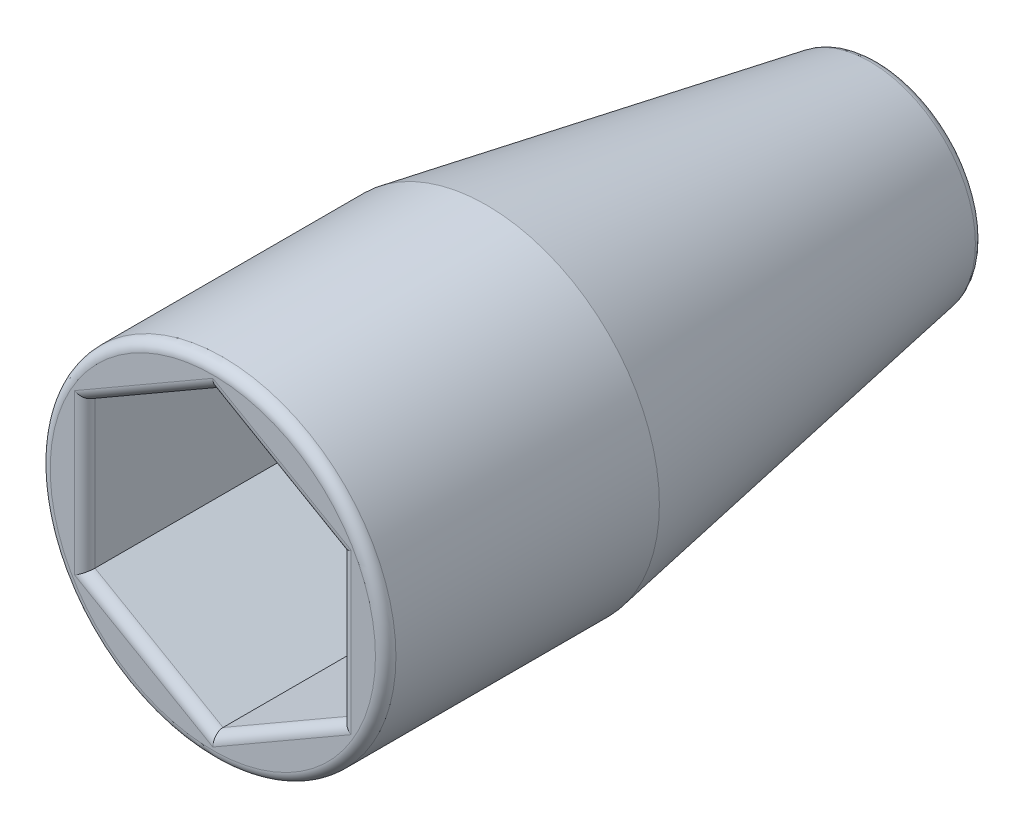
ISO-10303-21;
HEADER;
FILE_DESCRIPTION(('STEP AP214'),'2;1');
FILE_NAME('part.step','',(''),(''),'','','');
FILE_SCHEMA(('AUTOMOTIVE_DESIGN { 1 0 10303 214 1 1 1 1 }'));
ENDSEC;
DATA;
#1=APPLICATION_CONTEXT('core data for automotive mechanical design processes');
#2=APPLICATION_PROTOCOL_DEFINITION('international standard','automotive_design',2000,#1);
#3=PRODUCT_CONTEXT('',#1,'mechanical');
#4=PRODUCT('Part','Part','',(#3));
#5=PRODUCT_RELATED_PRODUCT_CATEGORY('part','',(#4));
#6=PRODUCT_DEFINITION_FORMATION('','',#4);
#7=PRODUCT_DEFINITION_CONTEXT('part definition',#1,'design');
#8=PRODUCT_DEFINITION('design','',#6,#7);
#9=PRODUCT_DEFINITION_SHAPE('','',#8);
#10=(LENGTH_UNIT() NAMED_UNIT(*) SI_UNIT(.MILLI.,.METRE.));
#11=(NAMED_UNIT(*) PLANE_ANGLE_UNIT() SI_UNIT($,.RADIAN.));
#12=(NAMED_UNIT(*) SI_UNIT($,.STERADIAN.) SOLID_ANGLE_UNIT());
#13=UNCERTAINTY_MEASURE_WITH_UNIT(LENGTH_MEASURE(1.E-05),#10,'distance_accuracy_value','');
#14=(GEOMETRIC_REPRESENTATION_CONTEXT(3) GLOBAL_UNCERTAINTY_ASSIGNED_CONTEXT((#13)) GLOBAL_UNIT_ASSIGNED_CONTEXT((#10,
#11,#12)) REPRESENTATION_CONTEXT('',''));
#15=CARTESIAN_POINT('',(0.,0.,0.));
#16=DIRECTION('',(0.,0.,1.));
#17=DIRECTION('',(1.,0.,0.));
#18=AXIS2_PLACEMENT_3D('',#15,#16,#17);
#19=CARTESIAN_POINT('',(0.,0.,26.));
#20=DIRECTION('',(0.,0.,-1.));
#21=DIRECTION('',(-1.,0.,0.));
#22=AXIS2_PLACEMENT_3D('',#19,#20,#21);
#23=CYLINDRICAL_SURFACE('',#22,6.75);
#24=CARTESIAN_POINT('',(0.,0.,25.6));
#25=DIRECTION('',(0.,0.,1.));
#26=DIRECTION('',(1.,0.,0.));
#27=AXIS2_PLACEMENT_3D('',#24,#25,#26);
#28=CIRCLE('',#27,6.75);
#29=CARTESIAN_POINT('',(-6.75,0.,25.6));
#30=VERTEX_POINT('',#29);
#31=EDGE_CURVE('E223',#30,#30,#28,.F.);
#32=CARTESIAN_POINT('',(0.,0.,15.3124609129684));
#33=DIRECTION('',(0.,0.,-1.));
#34=DIRECTION('',(-1.,0.,0.));
#35=AXIS2_PLACEMENT_3D('',#32,#33,#34);
#36=CIRCLE('',#35,6.75);
#37=CARTESIAN_POINT('',(-6.75,0.,15.3124609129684));
#38=VERTEX_POINT('',#37);
#39=EDGE_CURVE('E154',#38,#38,#36,.T.);
#40=CARTESIAN_POINT('',(-6.75,0.,25.6));
#41=CARTESIAN_POINT('',(-6.75,0.,25.4928381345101));
#42=CARTESIAN_POINT('',(-6.75,0.,25.3856762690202));
#43=CARTESIAN_POINT('',(-6.75,0.,25.1713525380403));
#44=CARTESIAN_POINT('',(-6.75,0.,25.0641906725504));
#45=CARTESIAN_POINT('',(-6.75,0.,24.8498669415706));
#46=CARTESIAN_POINT('',(-6.75,0.,24.7427050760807));
#47=CARTESIAN_POINT('',(-6.75,0.,24.5283813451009));
#48=CARTESIAN_POINT('',(-6.75,0.,24.421219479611));
#49=CARTESIAN_POINT('',(-6.75,0.,24.2068957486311));
#50=CARTESIAN_POINT('',(-6.75,0.,24.0997338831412));
#51=CARTESIAN_POINT('',(-6.75,0.,23.8854101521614));
#52=CARTESIAN_POINT('',(-6.75,0.,23.7782482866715));
#53=CARTESIAN_POINT('',(-6.75,0.,23.5639245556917));
#54=CARTESIAN_POINT('',(-6.75,0.,23.4567626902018));
#55=CARTESIAN_POINT('',(-6.75,0.,23.2424389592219));
#56=CARTESIAN_POINT('',(-6.75,0.,23.135277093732));
#57=CARTESIAN_POINT('',(-6.75,0.,22.9209533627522));
#58=CARTESIAN_POINT('',(-6.75,0.,22.8137914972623));
#59=CARTESIAN_POINT('',(-6.75,0.,22.5994677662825));
#60=CARTESIAN_POINT('',(-6.75,0.,22.4923059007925));
#61=CARTESIAN_POINT('',(-6.75,0.,22.2779821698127));
#62=CARTESIAN_POINT('',(-6.75,0.,22.1708203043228));
#63=CARTESIAN_POINT('',(-6.75,0.,21.956496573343));
#64=CARTESIAN_POINT('',(-6.75,0.,21.8493347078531));
#65=CARTESIAN_POINT('',(-6.75,0.,21.6350109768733));
#66=CARTESIAN_POINT('',(-6.75,0.,21.5278491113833));
#67=CARTESIAN_POINT('',(-6.75,0.,21.3135253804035));
#68=CARTESIAN_POINT('',(-6.75,0.,21.2063635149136));
#69=CARTESIAN_POINT('',(-6.75,0.,20.9920397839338));
#70=CARTESIAN_POINT('',(-6.75,0.,20.8848779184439));
#71=CARTESIAN_POINT('',(-6.75,0.,20.670554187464));
#72=CARTESIAN_POINT('',(-6.75,0.,20.5633923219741));
#73=CARTESIAN_POINT('',(-6.75,0.,20.3490685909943));
#74=CARTESIAN_POINT('',(-6.75,0.,20.2419067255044));
#75=CARTESIAN_POINT('',(-6.75,0.,20.0275829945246));
#76=CARTESIAN_POINT('',(-6.75,0.,19.9204211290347));
#77=CARTESIAN_POINT('',(-6.75,0.,19.7060973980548));
#78=CARTESIAN_POINT('',(-6.75,0.,19.5989355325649));
#79=CARTESIAN_POINT('',(-6.75,0.,19.3846118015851));
#80=CARTESIAN_POINT('',(-6.75,0.,19.2774499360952));
#81=CARTESIAN_POINT('',(-6.75,0.,19.0631262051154));
#82=CARTESIAN_POINT('',(-6.75,0.,18.9559643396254));
#83=CARTESIAN_POINT('',(-6.75,0.,18.7416406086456));
#84=CARTESIAN_POINT('',(-6.75,0.,18.6344787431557));
#85=CARTESIAN_POINT('',(-6.75,0.,18.4201550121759));
#86=CARTESIAN_POINT('',(-6.75,0.,18.312993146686));
#87=CARTESIAN_POINT('',(-6.75,0.,18.0986694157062));
#88=CARTESIAN_POINT('',(-6.75,0.,17.9915075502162));
#89=CARTESIAN_POINT('',(-6.75,0.,17.7771838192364));
#90=CARTESIAN_POINT('',(-6.75,0.,17.6700219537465));
#91=CARTESIAN_POINT('',(-6.75,0.,17.4556982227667));
#92=CARTESIAN_POINT('',(-6.75,0.,17.3485363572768));
#93=CARTESIAN_POINT('',(-6.75,0.,17.1342126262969));
#94=CARTESIAN_POINT('',(-6.75,0.,17.027050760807));
#95=CARTESIAN_POINT('',(-6.75,0.,16.8127270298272));
#96=CARTESIAN_POINT('',(-6.75,0.,16.7055651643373));
#97=CARTESIAN_POINT('',(-6.75,0.,16.4912414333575));
#98=CARTESIAN_POINT('',(-6.75,0.,16.3840795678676));
#99=CARTESIAN_POINT('',(-6.75,0.,16.1697558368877));
#100=CARTESIAN_POINT('',(-6.75,0.,16.0625939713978));
#101=CARTESIAN_POINT('',(-6.75,0.,15.848270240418));
#102=CARTESIAN_POINT('',(-6.75,0.,15.7411083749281));
#103=CARTESIAN_POINT('',(-6.75,0.,15.5267846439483));
#104=CARTESIAN_POINT('',(-6.75,0.,15.4196227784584));
#105=CARTESIAN_POINT('',(-6.75,0.,15.3124609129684));
#106=B_SPLINE_CURVE_WITH_KNOTS('',3,(#40,#41,#42,#43,#44,#45,#46,#47,#48,#49,#50,#51,#52,#53,
#54,#55,#56,#57,#58,#59,#60,#61,#62,#63,#64,#65,#66,#67,#68,#69,#70,#71,#72,#73,#74,#75,#76,#77,
#78,#79,#80,#81,#82,#83,#84,#85,#86,#87,#88,#89,#90,#91,#92,#93,#94,#95,#96,#97,#98,#99,#100,
#101,#102,#103,#104,#105),.UNSPECIFIED.,.F.,.F.,(4,2,2,2,2,2,2,2,2,2,2,2,2,2,2,2,2,2,2,2,2,2,2,
2,2,2,2,2,2,2,2,2,4),(0.,0.321485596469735,0.642971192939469,0.964456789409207,1.28594238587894,
1.60742798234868,1.92891357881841,2.25039917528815,2.57188477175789,2.89337036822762,
3.21485596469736,3.5363415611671,3.85782715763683,4.17931275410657,4.5007983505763,
4.82228394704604,5.14376954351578,5.46525513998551,5.78674073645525,6.10822633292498,
6.42971192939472,6.75119752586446,7.07268312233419,7.39416871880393,7.71565431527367,
8.0371399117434,8.35862550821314,8.68011110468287,9.00159670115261,9.32308229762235,
9.64456789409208,9.96605349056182,10.2875390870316),.UNSPECIFIED.);
#107=EDGE_CURVE('BSEAM47',#30,#38,#106,.T.);
#108=ORIENTED_EDGE('',*,*,#31,.T.);
#109=ORIENTED_EDGE('',*,*,#39,.F.);
#110=ORIENTED_EDGE('',*,*,#107,.T.);
#111=ORIENTED_EDGE('',*,*,#107,.F.);
#112=EDGE_LOOP('',(#108,#110,#109,#111));
#113=FACE_BOUND('',#112,.T.);
#114=ADVANCED_FACE('F47',(#113),#23,.T.);
#115=CARTESIAN_POINT('',(0.,0.,0.));
#116=DIRECTION('',(0.,0.,1.));
#117=DIRECTION('',(1.,0.,0.));
#118=AXIS2_PLACEMENT_3D('',#115,#116,#117);
#119=PLANE('',#118);
#120=CARTESIAN_POINT('',(0.,0.,0.));
#121=DIRECTION('',(0.,0.,1.));
#122=DIRECTION('',(1.,0.,0.));
#123=AXIS2_PLACEMENT_3D('',#120,#121,#122);
#124=CIRCLE('',#123,3.71436014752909);
#125=CARTESIAN_POINT('',(3.71436014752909,0.,0.));
#126=VERTEX_POINT('',#125);
#127=EDGE_CURVE('E188',#126,#126,#124,.F.);
#128=ORIENTED_EDGE('',*,*,#127,.T.);
#129=EDGE_LOOP('',(#128));
#130=FACE_BOUND('',#129,.T.);
#131=CARTESIAN_POINT('',(0.,0.,0.));
#132=DIRECTION('',(0.,0.,1.));
#133=DIRECTION('',(1.,0.,0.));
#134=AXIS2_PLACEMENT_3D('',#131,#132,#133);
#135=CIRCLE('',#134,3.6);
#136=CARTESIAN_POINT('',(3.6,0.,0.));
#137=VERTEX_POINT('',#136);
#138=EDGE_CURVE('E172',#137,#137,#135,.T.);
#139=ORIENTED_EDGE('',*,*,#138,.T.);
#140=EDGE_LOOP('',(#139));
#141=FACE_BOUND('',#140,.T.);
#142=ADVANCED_FACE('F310',(#130,#141),#119,.F.);
#143=CARTESIAN_POINT('',(0.,0.,26.));
#144=DIRECTION('',(0.,0.,1.));
#145=DIRECTION('',(1.,0.,0.));
#146=AXIS2_PLACEMENT_3D('',#143,#144,#145);
#147=PLANE('',#146);
#148=CARTESIAN_POINT('',(0.,0.,26.));
#149=DIRECTION('',(0.,0.,1.));
#150=DIRECTION('',(1.,0.,0.));
#151=AXIS2_PLACEMENT_3D('',#148,#149,#150);
#152=CIRCLE('',#151,6.35);
#153=CARTESIAN_POINT('',(6.35,0.,26.));
#154=VERTEX_POINT('',#153);
#155=EDGE_CURVE('E219',#154,#154,#152,.T.);
#156=ORIENTED_EDGE('',*,*,#155,.T.);
#157=EDGE_LOOP('',(#156));
#158=FACE_BOUND('',#157,.T.);
#159=DIRECTION('',(-0.866025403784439,0.5,0.));
#160=VECTOR('',#159,1.);
#161=CARTESIAN_POINT('',(5.2,3.23316150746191,26.));
#162=LINE('',#161,#160);
#163=CARTESIAN_POINT('',(0.,6.23538290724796,26.));
#164=VERTEX_POINT('',#163);
#165=CARTESIAN_POINT('',(5.4,3.11769145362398,26.));
#166=VERTEX_POINT('',#165);
#167=EDGE_CURVE('E212',#164,#166,#162,.F.);
#168=ORIENTED_EDGE('',*,*,#167,.T.);
#169=DIRECTION('',(0.,1.,0.));
#170=VECTOR('',#169,1.);
#171=CARTESIAN_POINT('',(5.4,-2.88675134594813,26.));
#172=LINE('',#171,#170);
#173=CARTESIAN_POINT('',(5.4,-3.11769145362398,26.));
#174=VERTEX_POINT('',#173);
#175=EDGE_CURVE('E215',#166,#174,#172,.F.);
#176=ORIENTED_EDGE('',*,*,#175,.T.);
#177=DIRECTION('',(0.866025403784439,0.5,0.));
#178=VECTOR('',#177,1.);
#179=CARTESIAN_POINT('',(0.199999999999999,-6.11991285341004,26.));
#180=LINE('',#179,#178);
#181=CARTESIAN_POINT('',(0.,-6.23538290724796,26.));
#182=VERTEX_POINT('',#181);
#183=EDGE_CURVE('E200',#174,#182,#180,.F.);
#184=ORIENTED_EDGE('',*,*,#183,.T.);
#185=DIRECTION('',(0.866025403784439,-0.5,0.));
#186=VECTOR('',#185,1.);
#187=CARTESIAN_POINT('',(-5.2,-3.23316150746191,26.));
#188=LINE('',#187,#186);
#189=CARTESIAN_POINT('',(-5.4,-3.11769145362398,26.));
#190=VERTEX_POINT('',#189);
#191=EDGE_CURVE('E203',#182,#190,#188,.F.);
#192=ORIENTED_EDGE('',*,*,#191,.T.);
#193=DIRECTION('',(0.,-1.,0.));
#194=VECTOR('',#193,1.);
#195=CARTESIAN_POINT('',(-5.4,2.88675134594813,26.));
#196=LINE('',#195,#194);
#197=CARTESIAN_POINT('',(-5.4,3.11769145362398,26.));
#198=VERTEX_POINT('',#197);
#199=EDGE_CURVE('E206',#190,#198,#196,.F.);
#200=ORIENTED_EDGE('',*,*,#199,.T.);
#201=DIRECTION('',(-0.866025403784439,-0.5,0.));
#202=VECTOR('',#201,1.);
#203=CARTESIAN_POINT('',(-0.200000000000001,6.11991285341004,26.));
#204=LINE('',#203,#202);
#205=EDGE_CURVE('E209',#198,#164,#204,.F.);
#206=ORIENTED_EDGE('',*,*,#205,.T.);
#207=EDGE_LOOP('',(#168,#176,#184,#192,#200,#206));
#208=FACE_BOUND('',#207,.T.);
#209=ADVANCED_FACE('F316',(#158,#208),#147,.T.);
#210=CARTESIAN_POINT('',(0.,-5.77350269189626,14.));
#211=DIRECTION('',(0.5,-0.866025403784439,0.));
#212=DIRECTION('',(0.866025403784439,0.5,0.));
#213=AXIS2_PLACEMENT_3D('',#210,#211,#212);
#214=PLANE('',#213);
#215=DIRECTION('',(0.,0.,1.));
#216=VECTOR('',#215,1.);
#217=CARTESIAN_POINT('',(0.,-5.77350269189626,14.));
#218=LINE('',#217,#216);
#219=CARTESIAN_POINT('',(0.,-5.77350269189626,14.));
#220=VERTEX_POINT('',#219);
#221=CARTESIAN_POINT('',(0.,-5.77350269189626,25.6));
#222=VERTEX_POINT('',#221);
#223=EDGE_CURVE('E169',#220,#222,#218,.T.);
#224=ORIENTED_EDGE('',*,*,#223,.T.);
#225=DIRECTION('',(0.866025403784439,0.5,0.));
#226=VECTOR('',#225,1.);
#227=CARTESIAN_POINT('',(5.,-2.88675134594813,25.6));
#228=LINE('',#227,#226);
#229=CARTESIAN_POINT('',(5.,-2.88675134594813,25.6));
#230=VERTEX_POINT('',#229);
#231=EDGE_CURVE('E128',#222,#230,#228,.T.);
#232=ORIENTED_EDGE('',*,*,#231,.T.);
#233=DIRECTION('',(0.,0.,1.));
#234=VECTOR('',#233,1.);
#235=CARTESIAN_POINT('',(5.,-2.88675134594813,14.));
#236=LINE('',#235,#234);
#237=CARTESIAN_POINT('',(5.,-2.88675134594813,14.));
#238=VERTEX_POINT('',#237);
#239=EDGE_CURVE('E121',#238,#230,#236,.T.);
#240=ORIENTED_EDGE('',*,*,#239,.F.);
#241=DIRECTION('',(0.866025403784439,0.5,0.));
#242=VECTOR('',#241,1.);
#243=CARTESIAN_POINT('',(0.,-5.77350269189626,14.));
#244=LINE('',#243,#242);
#245=EDGE_CURVE('E125',#220,#238,#244,.T.);
#246=ORIENTED_EDGE('',*,*,#245,.F.);
#247=EDGE_LOOP('',(#224,#232,#240,#246));
#248=FACE_BOUND('',#247,.T.);
#249=ADVANCED_FACE('F123',(#248),#214,.F.);
#250=CARTESIAN_POINT('',(-5.,-2.88675134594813,14.));
#251=DIRECTION('',(-0.5,-0.866025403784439,0.));
#252=DIRECTION('',(0.866025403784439,-0.5,0.));
#253=AXIS2_PLACEMENT_3D('',#250,#251,#252);
#254=PLANE('',#253);
#255=DIRECTION('',(0.,0.,1.));
#256=VECTOR('',#255,1.);
#257=CARTESIAN_POINT('',(-5.,-2.88675134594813,14.));
#258=LINE('',#257,#256);
#259=CARTESIAN_POINT('',(-5.,-2.88675134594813,14.));
#260=VERTEX_POINT('',#259);
#261=CARTESIAN_POINT('',(-5.,-2.88675134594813,25.6));
#262=VERTEX_POINT('',#261);
#263=EDGE_CURVE('E173',#260,#262,#258,.T.);
#264=ORIENTED_EDGE('',*,*,#263,.T.);
#265=DIRECTION('',(0.866025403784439,-0.5,0.));
#266=VECTOR('',#265,1.);
#267=CARTESIAN_POINT('',(0.,-5.77350269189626,25.6));
#268=LINE('',#267,#266);
#269=EDGE_CURVE('E64',#262,#222,#268,.T.);
#270=ORIENTED_EDGE('',*,*,#269,.T.);
#271=ORIENTED_EDGE('',*,*,#223,.F.);
#272=DIRECTION('',(0.866025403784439,-0.5,0.));
#273=VECTOR('',#272,1.);
#274=CARTESIAN_POINT('',(-5.,-2.88675134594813,14.));
#275=LINE('',#274,#273);
#276=EDGE_CURVE('E134',#260,#220,#275,.T.);
#277=ORIENTED_EDGE('',*,*,#276,.F.);
#278=EDGE_LOOP('',(#264,#270,#271,#277));
#279=FACE_BOUND('',#278,.T.);
#280=ADVANCED_FACE('F383',(#279),#254,.F.);
#281=CARTESIAN_POINT('',(-5.,2.88675134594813,14.));
#282=DIRECTION('',(-1.,0.,0.));
#283=DIRECTION('',(0.,0.,1.));
#284=AXIS2_PLACEMENT_3D('',#281,#282,#283);
#285=PLANE('',#284);
#286=DIRECTION('',(0.,0.,1.));
#287=VECTOR('',#286,1.);
#288=CARTESIAN_POINT('',(-5.,2.88675134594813,14.));
#289=LINE('',#288,#287);
#290=CARTESIAN_POINT('',(-5.,2.88675134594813,14.));
#291=VERTEX_POINT('',#290);
#292=CARTESIAN_POINT('',(-5.,2.88675134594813,25.6));
#293=VERTEX_POINT('',#292);
#294=EDGE_CURVE('E176',#291,#293,#289,.T.);
#295=ORIENTED_EDGE('',*,*,#294,.T.);
#296=DIRECTION('',(0.,-1.,0.));
#297=VECTOR('',#296,1.);
#298=CARTESIAN_POINT('',(-5.,-2.88675134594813,25.6));
#299=LINE('',#298,#297);
#300=EDGE_CURVE('E72',#293,#262,#299,.T.);
#301=ORIENTED_EDGE('',*,*,#300,.T.);
#302=ORIENTED_EDGE('',*,*,#263,.F.);
#303=DIRECTION('',(0.,-1.,0.));
#304=VECTOR('',#303,1.);
#305=CARTESIAN_POINT('',(-5.,2.88675134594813,14.));
#306=LINE('',#305,#304);
#307=EDGE_CURVE('E164',#291,#260,#306,.T.);
#308=ORIENTED_EDGE('',*,*,#307,.F.);
#309=EDGE_LOOP('',(#295,#301,#302,#308));
#310=FACE_BOUND('',#309,.T.);
#311=ADVANCED_FACE('F382',(#310),#285,.F.);
#312=CARTESIAN_POINT('',(0.,5.77350269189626,14.));
#313=DIRECTION('',(-0.5,0.866025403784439,0.));
#314=DIRECTION('',(-0.866025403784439,-0.5,0.));
#315=AXIS2_PLACEMENT_3D('',#312,#313,#314);
#316=PLANE('',#315);
#317=DIRECTION('',(0.,0.,1.));
#318=VECTOR('',#317,1.);
#319=CARTESIAN_POINT('',(0.,5.77350269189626,14.));
#320=LINE('',#319,#318);
#321=CARTESIAN_POINT('',(0.,5.77350269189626,14.));
#322=VERTEX_POINT('',#321);
#323=CARTESIAN_POINT('',(0.,5.77350269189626,25.6));
#324=VERTEX_POINT('',#323);
#325=EDGE_CURVE('E179',#322,#324,#320,.T.);
#326=ORIENTED_EDGE('',*,*,#325,.T.);
#327=DIRECTION('',(-0.866025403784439,-0.5,0.));
#328=VECTOR('',#327,1.);
#329=CARTESIAN_POINT('',(-5.,2.88675134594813,25.6));
#330=LINE('',#329,#328);
#331=EDGE_CURVE('E233',#324,#293,#330,.T.);
#332=ORIENTED_EDGE('',*,*,#331,.T.);
#333=ORIENTED_EDGE('',*,*,#294,.F.);
#334=DIRECTION('',(-0.866025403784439,-0.5,0.));
#335=VECTOR('',#334,1.);
#336=CARTESIAN_POINT('',(0.,5.77350269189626,14.));
#337=LINE('',#336,#335);
#338=EDGE_CURVE('E160',#322,#291,#337,.T.);
#339=ORIENTED_EDGE('',*,*,#338,.F.);
#340=EDGE_LOOP('',(#326,#332,#333,#339));
#341=FACE_BOUND('',#340,.T.);
#342=ADVANCED_FACE('F381',(#341),#316,.F.);
#343=CARTESIAN_POINT('',(5.,2.88675134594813,14.));
#344=DIRECTION('',(0.5,0.866025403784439,0.));
#345=DIRECTION('',(-0.866025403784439,0.5,0.));
#346=AXIS2_PLACEMENT_3D('',#343,#344,#345);
#347=PLANE('',#346);
#348=DIRECTION('',(0.,0.,1.));
#349=VECTOR('',#348,1.);
#350=CARTESIAN_POINT('',(5.,2.88675134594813,14.));
#351=LINE('',#350,#349);
#352=CARTESIAN_POINT('',(5.,2.88675134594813,14.));
#353=VERTEX_POINT('',#352);
#354=CARTESIAN_POINT('',(5.,2.88675134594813,25.6));
#355=VERTEX_POINT('',#354);
#356=EDGE_CURVE('E133',#353,#355,#351,.T.);
#357=ORIENTED_EDGE('',*,*,#356,.T.);
#358=DIRECTION('',(-0.866025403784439,0.5,0.));
#359=VECTOR('',#358,1.);
#360=CARTESIAN_POINT('',(0.,5.77350269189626,25.6));
#361=LINE('',#360,#359);
#362=EDGE_CURVE('E230',#355,#324,#361,.T.);
#363=ORIENTED_EDGE('',*,*,#362,.T.);
#364=ORIENTED_EDGE('',*,*,#325,.F.);
#365=DIRECTION('',(-0.866025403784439,0.5,0.));
#366=VECTOR('',#365,1.);
#367=CARTESIAN_POINT('',(5.,2.88675134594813,14.));
#368=LINE('',#367,#366);
#369=EDGE_CURVE('E144',#353,#322,#368,.T.);
#370=ORIENTED_EDGE('',*,*,#369,.F.);
#371=EDGE_LOOP('',(#357,#363,#364,#370));
#372=FACE_BOUND('',#371,.T.);
#373=ADVANCED_FACE('F306',(#372),#347,.F.);
#374=CARTESIAN_POINT('',(5.,-2.88675134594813,14.));
#375=DIRECTION('',(1.,0.,0.));
#376=DIRECTION('',(0.,1.,0.));
#377=AXIS2_PLACEMENT_3D('',#374,#375,#376);
#378=PLANE('',#377);
#379=ORIENTED_EDGE('',*,*,#239,.T.);
#380=DIRECTION('',(0.,1.,0.));
#381=VECTOR('',#380,1.);
#382=CARTESIAN_POINT('',(5.,2.88675134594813,25.6));
#383=LINE('',#382,#381);
#384=EDGE_CURVE('E227',#230,#355,#383,.T.);
#385=ORIENTED_EDGE('',*,*,#384,.T.);
#386=ORIENTED_EDGE('',*,*,#356,.F.);
#387=DIRECTION('',(0.,1.,0.));
#388=VECTOR('',#387,1.);
#389=CARTESIAN_POINT('',(5.,-2.88675134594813,14.));
#390=LINE('',#389,#388);
#391=EDGE_CURVE('E137',#238,#353,#390,.T.);
#392=ORIENTED_EDGE('',*,*,#391,.F.);
#393=EDGE_LOOP('',(#379,#385,#386,#392));
#394=FACE_BOUND('',#393,.T.);
#395=ADVANCED_FACE('F138',(#394),#378,.F.);
#396=CARTESIAN_POINT('',(0.,0.,14.));
#397=DIRECTION('',(0.,0.,1.));
#398=DIRECTION('',(1.,0.,0.));
#399=AXIS2_PLACEMENT_3D('',#396,#397,#398);
#400=PLANE('',#399);
#401=CARTESIAN_POINT('',(0.,0.,14.));
#402=DIRECTION('',(0.,0.,1.));
#403=DIRECTION('',(1.,0.,0.));
#404=AXIS2_PLACEMENT_3D('',#401,#402,#403);
#405=CIRCLE('',#404,2.03867513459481);
#406=CARTESIAN_POINT('',(2.03867513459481,0.,14.));
#407=VERTEX_POINT('',#406);
#408=EDGE_CURVE('E11',#407,#407,#405,.F.);
#409=ORIENTED_EDGE('',*,*,#408,.T.);
#410=EDGE_LOOP('',(#409));
#411=FACE_BOUND('',#410,.T.);
#412=ORIENTED_EDGE('',*,*,#245,.T.);
#413=ORIENTED_EDGE('',*,*,#391,.T.);
#414=ORIENTED_EDGE('',*,*,#369,.T.);
#415=ORIENTED_EDGE('',*,*,#338,.T.);
#416=ORIENTED_EDGE('',*,*,#307,.T.);
#417=ORIENTED_EDGE('',*,*,#276,.T.);
#418=EDGE_LOOP('',(#412,#413,#414,#415,#416,#417));
#419=FACE_BOUND('',#418,.T.);
#420=ADVANCED_FACE('F146',(#411,#419),#400,.T.);
#421=CARTESIAN_POINT('',(0.,0.,10.));
#422=DIRECTION('',(0.,0.,-1.));
#423=DIRECTION('',(-1.,0.,0.));
#424=AXIS2_PLACEMENT_3D('',#421,#422,#423);
#425=CYLINDRICAL_SURFACE('',#424,3.2);
#426=CARTESIAN_POINT('',(0.,0.,0.399999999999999));
#427=DIRECTION('',(0.,0.,1.));
#428=DIRECTION('',(1.,0.,0.));
#429=AXIS2_PLACEMENT_3D('',#426,#427,#428);
#430=CIRCLE('',#429,3.2);
#431=CARTESIAN_POINT('',(3.2,0.,0.399999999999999));
#432=VERTEX_POINT('',#431);
#433=EDGE_CURVE('E196',#432,#432,#430,.F.);
#434=ORIENTED_EDGE('',*,*,#433,.T.);
#435=EDGE_LOOP('',(#434));
#436=FACE_BOUND('',#435,.T.);
#437=CARTESIAN_POINT('',(0.,0.,10.));
#438=DIRECTION('',(0.,0.,-1.));
#439=DIRECTION('',(-1.,0.,0.));
#440=AXIS2_PLACEMENT_3D('',#437,#438,#439);
#441=CIRCLE('',#440,3.2);
#442=CARTESIAN_POINT('',(-3.2,0.,10.));
#443=VERTEX_POINT('',#442);
#444=EDGE_CURVE('E150',#443,#443,#441,.T.);
#445=ORIENTED_EDGE('',*,*,#444,.F.);
#446=EDGE_LOOP('',(#445));
#447=FACE_BOUND('',#446,.T.);
#448=ADVANCED_FACE('F296',(#436,#447),#425,.F.);
#449=CARTESIAN_POINT('',(0.,0.,10.));
#450=DIRECTION('',(0.,0.,-1.));
#451=DIRECTION('',(-1.,0.,0.));
#452=AXIS2_PLACEMENT_3D('',#449,#450,#451);
#453=PLANE('',#452);
#454=CARTESIAN_POINT('',(0.,0.,10.));
#455=DIRECTION('',(0.,0.,-1.));
#456=DIRECTION('',(-1.,0.,0.));
#457=AXIS2_PLACEMENT_3D('',#454,#455,#456);
#458=CIRCLE('',#457,2.25000000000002);
#459=CARTESIAN_POINT('',(-2.25000000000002,0.,10.));
#460=VERTEX_POINT('',#459);
#461=EDGE_CURVE('E57',#460,#460,#458,.F.);
#462=ORIENTED_EDGE('',*,*,#461,.T.);
#463=EDGE_LOOP('',(#462));
#464=FACE_BOUND('',#463,.T.);
#465=ORIENTED_EDGE('',*,*,#444,.T.);
#466=EDGE_LOOP('',(#465));
#467=FACE_BOUND('',#466,.T.);
#468=ADVANCED_FACE('F275',(#464,#467),#453,.T.);
#469=CARTESIAN_POINT('',(0.,0.,26.001));
#470=DIRECTION('',(0.,0.,-1.));
#471=DIRECTION('',(-1.,0.,0.));
#472=AXIS2_PLACEMENT_3D('',#469,#470,#471);
#473=CYLINDRICAL_SURFACE('',#472,1.75);
#474=CARTESIAN_POINT('',(0.,0.,10.2886751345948));
#475=DIRECTION('',(0.,0.,-1.));
#476=DIRECTION('',(-1.,0.,0.));
#477=AXIS2_PLACEMENT_3D('',#474,#475,#476);
#478=CIRCLE('',#477,1.75);
#479=CARTESIAN_POINT('',(-1.75,0.,10.2886751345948));
#480=VERTEX_POINT('',#479);
#481=EDGE_CURVE('E268',#480,#480,#478,.T.);
#482=ORIENTED_EDGE('',*,*,#481,.T.);
#483=EDGE_LOOP('',(#482));
#484=FACE_BOUND('',#483,.T.);
#485=CARTESIAN_POINT('',(0.,0.,13.5));
#486=DIRECTION('',(0.,0.,1.));
#487=DIRECTION('',(1.,0.,0.));
#488=AXIS2_PLACEMENT_3D('',#485,#486,#487);
#489=CIRCLE('',#488,1.75);
#490=CARTESIAN_POINT('',(1.75,0.,13.5));
#491=VERTEX_POINT('',#490);
#492=EDGE_CURVE('E242',#491,#491,#489,.T.);
#493=ORIENTED_EDGE('',*,*,#492,.T.);
#494=EDGE_LOOP('',(#493));
#495=FACE_BOUND('',#494,.T.);
#496=ADVANCED_FACE('F284',(#484,#495),#473,.F.);
#497=CARTESIAN_POINT('',(0.,0.,0.));
#498=DIRECTION('',(0.,0.,1.));
#499=DIRECTION('',(1.,0.,0.));
#500=AXIS2_PLACEMENT_3D('',#497,#498,#499);
#501=CONICAL_SURFACE('',#500,4.05,0.174532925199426);
#502=CARTESIAN_POINT('',(0.,0.,0.330540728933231));
#503=DIRECTION('',(0.,0.,1.));
#504=DIRECTION('',(1.,0.,0.));
#505=AXIS2_PLACEMENT_3D('',#502,#503,#504);
#506=CIRCLE('',#505,4.10828324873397);
#507=CARTESIAN_POINT('',(4.10828324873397,0.,0.330540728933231));
#508=VERTEX_POINT('',#507);
#509=EDGE_CURVE('E192',#508,#508,#506,.T.);
#510=ORIENTED_EDGE('',*,*,#509,.T.);
#511=EDGE_LOOP('',(#510));
#512=FACE_BOUND('',#511,.T.);
#513=ORIENTED_EDGE('',*,*,#39,.T.);
#514=EDGE_LOOP('',(#513));
#515=FACE_BOUND('',#514,.T.);
#516=ADVANCED_FACE('F287',(#512,#515),#501,.T.);
#517=CARTESIAN_POINT('',(0.,0.,0.4));
#518=DIRECTION('',(0.,0.,1.));
#519=DIRECTION('',(1.,0.,0.));
#520=AXIS2_PLACEMENT_3D('',#517,#518,#519);
#521=TOROIDAL_SURFACE('',#520,3.71436014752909,0.4);
#522=ORIENTED_EDGE('',*,*,#509,.F.);
#523=EDGE_LOOP('',(#522));
#524=FACE_BOUND('',#523,.T.);
#525=ORIENTED_EDGE('',*,*,#127,.F.);
#526=EDGE_LOOP('',(#525));
#527=FACE_BOUND('',#526,.T.);
#528=ADVANCED_FACE('F322',(#524,#527),#521,.T.);
#529=CARTESIAN_POINT('',(0.,0.,0.399999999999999));
#530=DIRECTION('',(0.,0.,1.));
#531=DIRECTION('',(1.,0.,0.));
#532=AXIS2_PLACEMENT_3D('',#529,#530,#531);
#533=TOROIDAL_SURFACE('',#532,3.6,0.4);
#534=ORIENTED_EDGE('',*,*,#138,.F.);
#535=EDGE_LOOP('',(#534));
#536=FACE_BOUND('',#535,.T.);
#537=ORIENTED_EDGE('',*,*,#433,.F.);
#538=EDGE_LOOP('',(#537));
#539=FACE_BOUND('',#538,.T.);
#540=ADVANCED_FACE('F325',(#536,#539),#533,.T.);
#541=CARTESIAN_POINT('',(0.,0.,25.6));
#542=DIRECTION('',(0.,0.,1.));
#543=DIRECTION('',(1.,0.,0.));
#544=AXIS2_PLACEMENT_3D('',#541,#542,#543);
#545=TOROIDAL_SURFACE('',#544,6.35,0.4);
#546=ORIENTED_EDGE('',*,*,#31,.F.);
#547=EDGE_LOOP('',(#546));
#548=FACE_BOUND('',#547,.T.);
#549=ORIENTED_EDGE('',*,*,#155,.F.);
#550=EDGE_LOOP('',(#549));
#551=FACE_BOUND('',#550,.T.);
#552=ADVANCED_FACE('F329',(#548,#551),#545,.T.);
#553=CARTESIAN_POINT('',(-5.4,2.88675134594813,25.6));
#554=DIRECTION('',(0.,1.,0.));
#555=DIRECTION('',(0.,0.,1.));
#556=AXIS2_PLACEMENT_3D('',#553,#554,#555);
#557=CYLINDRICAL_SURFACE('',#556,0.4);
#558=CARTESIAN_POINT('',(-5.4,3.11769145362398,25.6));
#559=DIRECTION('',(0.5,0.866025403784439,0.));
#560=DIRECTION('',(0.866025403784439,-0.5,0.));
#561=AXIS2_PLACEMENT_3D('',#558,#559,#560);
#562=ELLIPSE('',#561,0.461880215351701,0.4);
#563=EDGE_CURVE('E257',#198,#293,#562,.T.);
#564=ORIENTED_EDGE('',*,*,#563,.F.);
#565=ORIENTED_EDGE('',*,*,#199,.F.);
#566=CARTESIAN_POINT('',(-5.4,-3.11769145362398,25.6));
#567=DIRECTION('',(-0.5,0.866025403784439,0.));
#568=DIRECTION('',(0.866025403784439,0.5,0.));
#569=AXIS2_PLACEMENT_3D('',#566,#567,#568);
#570=ELLIPSE('',#569,0.461880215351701,0.4);
#571=EDGE_CURVE('E261',#262,#190,#570,.F.);
#572=ORIENTED_EDGE('',*,*,#571,.F.);
#573=ORIENTED_EDGE('',*,*,#300,.F.);
#574=EDGE_LOOP('',(#564,#565,#572,#573));
#575=FACE_BOUND('',#574,.T.);
#576=ADVANCED_FACE('F333',(#575),#557,.T.);
#577=CARTESIAN_POINT('',(-5.2,-3.23316150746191,25.6));
#578=DIRECTION('',(-0.866025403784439,0.5,0.));
#579=DIRECTION('',(-0.5,-0.866025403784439,0.));
#580=AXIS2_PLACEMENT_3D('',#577,#578,#579);
#581=CYLINDRICAL_SURFACE('',#580,0.4);
#582=ORIENTED_EDGE('',*,*,#571,.T.);
#583=ORIENTED_EDGE('',*,*,#191,.F.);
#584=CARTESIAN_POINT('',(0.,-6.23538290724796,25.6));
#585=DIRECTION('',(-1.,0.,0.));
#586=DIRECTION('',(0.,1.,0.));
#587=AXIS2_PLACEMENT_3D('',#584,#585,#586);
#588=ELLIPSE('',#587,0.461880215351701,0.4);
#589=EDGE_CURVE('E253',#222,#182,#588,.F.);
#590=ORIENTED_EDGE('',*,*,#589,.F.);
#591=ORIENTED_EDGE('',*,*,#269,.F.);
#592=EDGE_LOOP('',(#582,#583,#590,#591));
#593=FACE_BOUND('',#592,.T.);
#594=ADVANCED_FACE('F348',(#593),#581,.T.);
#595=CARTESIAN_POINT('',(-0.200000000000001,6.11991285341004,25.6));
#596=DIRECTION('',(0.866025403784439,0.5,0.));
#597=DIRECTION('',(-0.5,0.866025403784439,0.));
#598=AXIS2_PLACEMENT_3D('',#595,#596,#597);
#599=CYLINDRICAL_SURFACE('',#598,0.4);
#600=ORIENTED_EDGE('',*,*,#563,.T.);
#601=ORIENTED_EDGE('',*,*,#331,.F.);
#602=CARTESIAN_POINT('',(0.,6.23538290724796,25.6));
#603=DIRECTION('',(1.,0.,0.));
#604=DIRECTION('',(0.,-1.,0.));
#605=AXIS2_PLACEMENT_3D('',#602,#603,#604);
#606=ELLIPSE('',#605,0.461880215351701,0.4);
#607=EDGE_CURVE('E249',#164,#324,#606,.T.);
#608=ORIENTED_EDGE('',*,*,#607,.F.);
#609=ORIENTED_EDGE('',*,*,#205,.F.);
#610=EDGE_LOOP('',(#600,#601,#608,#609));
#611=FACE_BOUND('',#610,.T.);
#612=ADVANCED_FACE('F344',(#611),#599,.T.);
#613=CARTESIAN_POINT('',(0.199999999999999,-6.11991285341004,25.6));
#614=DIRECTION('',(-0.866025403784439,-0.5,0.));
#615=DIRECTION('',(0.5,-0.866025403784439,0.));
#616=AXIS2_PLACEMENT_3D('',#613,#614,#615);
#617=CYLINDRICAL_SURFACE('',#616,0.4);
#618=ORIENTED_EDGE('',*,*,#589,.T.);
#619=ORIENTED_EDGE('',*,*,#183,.F.);
#620=CARTESIAN_POINT('',(5.4,-3.11769145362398,25.6));
#621=DIRECTION('',(-0.5,-0.866025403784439,0.));
#622=DIRECTION('',(0.866025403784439,-0.5,0.));
#623=AXIS2_PLACEMENT_3D('',#620,#621,#622);
#624=ELLIPSE('',#623,0.461880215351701,0.4);
#625=EDGE_CURVE('E246',#230,#174,#624,.F.);
#626=ORIENTED_EDGE('',*,*,#625,.F.);
#627=ORIENTED_EDGE('',*,*,#231,.F.);
#628=EDGE_LOOP('',(#618,#619,#626,#627));
#629=FACE_BOUND('',#628,.T.);
#630=ADVANCED_FACE('F340',(#629),#617,.T.);
#631=CARTESIAN_POINT('',(5.2,3.23316150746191,25.6));
#632=DIRECTION('',(0.866025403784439,-0.5,0.));
#633=DIRECTION('',(0.5,0.866025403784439,0.));
#634=AXIS2_PLACEMENT_3D('',#631,#632,#633);
#635=CYLINDRICAL_SURFACE('',#634,0.4);
#636=ORIENTED_EDGE('',*,*,#607,.T.);
#637=ORIENTED_EDGE('',*,*,#362,.F.);
#638=CARTESIAN_POINT('',(5.4,3.11769145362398,25.6));
#639=DIRECTION('',(0.5,-0.866025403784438,0.));
#640=DIRECTION('',(-0.866025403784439,-0.5,0.));
#641=AXIS2_PLACEMENT_3D('',#638,#639,#640);
#642=ELLIPSE('',#641,0.461880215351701,0.4);
#643=EDGE_CURVE('E243',#166,#355,#642,.T.);
#644=ORIENTED_EDGE('',*,*,#643,.F.);
#645=ORIENTED_EDGE('',*,*,#167,.F.);
#646=EDGE_LOOP('',(#636,#637,#644,#645));
#647=FACE_BOUND('',#646,.T.);
#648=ADVANCED_FACE('F336',(#647),#635,.T.);
#649=CARTESIAN_POINT('',(5.4,-2.88675134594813,25.6));
#650=DIRECTION('',(0.,-1.,0.));
#651=DIRECTION('',(1.,0.,0.));
#652=AXIS2_PLACEMENT_3D('',#649,#650,#651);
#653=CYLINDRICAL_SURFACE('',#652,0.4);
#654=ORIENTED_EDGE('',*,*,#625,.T.);
#655=ORIENTED_EDGE('',*,*,#175,.F.);
#656=ORIENTED_EDGE('',*,*,#643,.T.);
#657=ORIENTED_EDGE('',*,*,#384,.F.);
#658=EDGE_LOOP('',(#654,#655,#656,#657));
#659=FACE_BOUND('',#658,.T.);
#660=ADVANCED_FACE('F281',(#659),#653,.T.);
#661=CARTESIAN_POINT('',(0.,0.,10.2886751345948));
#662=DIRECTION('',(0.,0.,-1.));
#663=DIRECTION('',(-1.,0.,0.));
#664=AXIS2_PLACEMENT_3D('',#661,#662,#663);
#665=CONICAL_SURFACE('',#664,1.75,1.0471975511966);
#666=ORIENTED_EDGE('',*,*,#461,.F.);
#667=EDGE_LOOP('',(#666));
#668=FACE_BOUND('',#667,.T.);
#669=ORIENTED_EDGE('',*,*,#481,.F.);
#670=EDGE_LOOP('',(#669));
#671=FACE_BOUND('',#670,.T.);
#672=ADVANCED_FACE('F278',(#668,#671),#665,.F.);
#673=CARTESIAN_POINT('',(0.,0.,14.));
#674=DIRECTION('',(0.,0.,1.));
#675=DIRECTION('',(1.,0.,0.));
#676=AXIS2_PLACEMENT_3D('',#673,#674,#675);
#677=CONICAL_SURFACE('',#676,2.03867513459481,0.523598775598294);
#678=ORIENTED_EDGE('',*,*,#492,.F.);
#679=EDGE_LOOP('',(#678));
#680=FACE_BOUND('',#679,.T.);
#681=ORIENTED_EDGE('',*,*,#408,.F.);
#682=EDGE_LOOP('',(#681));
#683=FACE_BOUND('',#682,.T.);
#684=ADVANCED_FACE('F50',(#680,#683),#677,.F.);
#685=CLOSED_SHELL('',(#114,#142,#209,#249,#280,#311,#342,#373,#395,#420,#448,#468,#496,#516,
#528,#540,#552,#576,#594,#612,#630,#648,#660,#672,#684));
#686=MANIFOLD_SOLID_BREP('B2',#685);
#687=ADVANCED_BREP_SHAPE_REPRESENTATION('',(#18,#686),#14);
#688=SHAPE_DEFINITION_REPRESENTATION(#9,#687);
ENDSEC;
END-ISO-10303-21;
